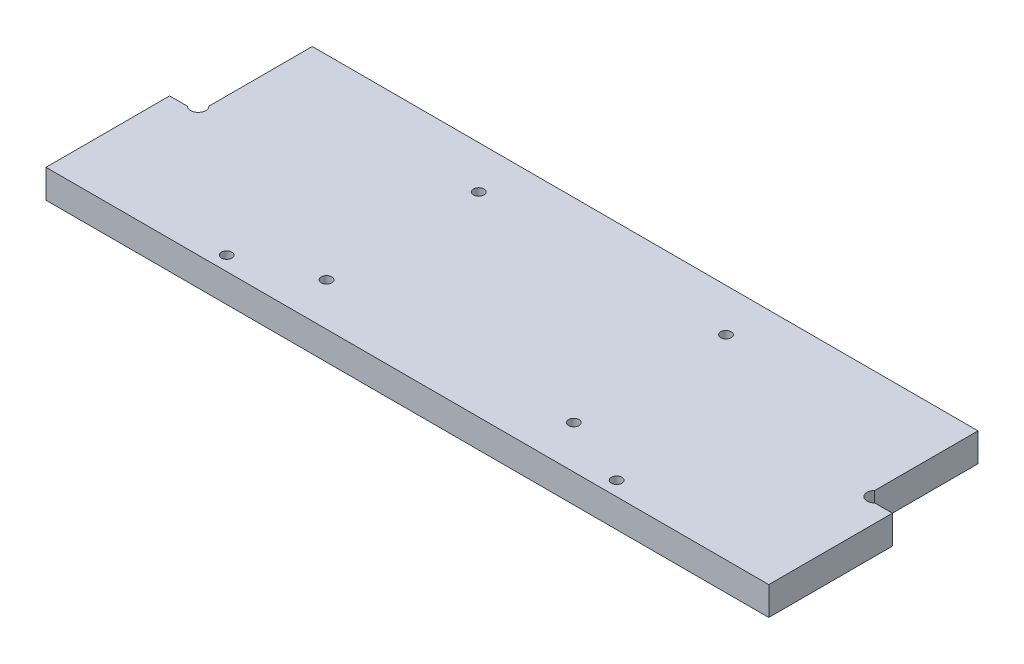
from build123d import *

# Parameters (mm, degrees)
ESQUISSE1_R        = 1.1
BOSS_EXTRU_1_DEPTH = 6


with BuildPart() as part:
    # Esquisse1 → Boss.-Extru.1 (new body)
    with BuildSketch(Plane(origin=(0, 0, 0), x_dir=(1, 0, 0), z_dir=(0, 1, 0))):
        with BuildLine():
            Line((146, 28.2627417), (146, 50))
            Line((146, 50), (6, 50))
            Line((6, 50), (6, 28.2627417))
            ThreePointArc((6, 28.2627417), (6, 26), (3.7372583, 26))
            Line((3.7372583, 26), (0, 26))
            Line((0, 26), (0, 0))
            Line((0, 0), (152, 0))
            Line((152, 0), (152, 26))
            Line((152, 26), (148.2627417, 26))
            ThreePointArc((148.2627417, 26), (146, 26), (146, 28.2627417))
        make_face()
        with Locations(Location((117, 3, 0), (0, 0, 270))):
            Circle(ESQUISSE1_R, mode=Mode.SUBTRACT)
        with Locations(Location((35, 3, 0), (0, 0, 90))):
            Circle(ESQUISSE1_R, mode=Mode.SUBTRACT)
        with Locations(Location((50, 9, 0), (0, 0, 270))):
            Circle(ESQUISSE1_R, mode=Mode.SUBTRACT)
        with Locations(Location((102, 9, 0), (0, 0, 90))):
            Circle(ESQUISSE1_R, mode=Mode.SUBTRACT)
        with Locations(Location((102, 41, 0), (0, 0, 270))):
            Circle(ESQUISSE1_R, mode=Mode.SUBTRACT)
        with Locations(Location((50, 41, 0), (0, 0, 90))):
            Circle(ESQUISSE1_R, mode=Mode.SUBTRACT)
    extrude(amount=BOSS_EXTRU_1_DEPTH)


solid = part.part
